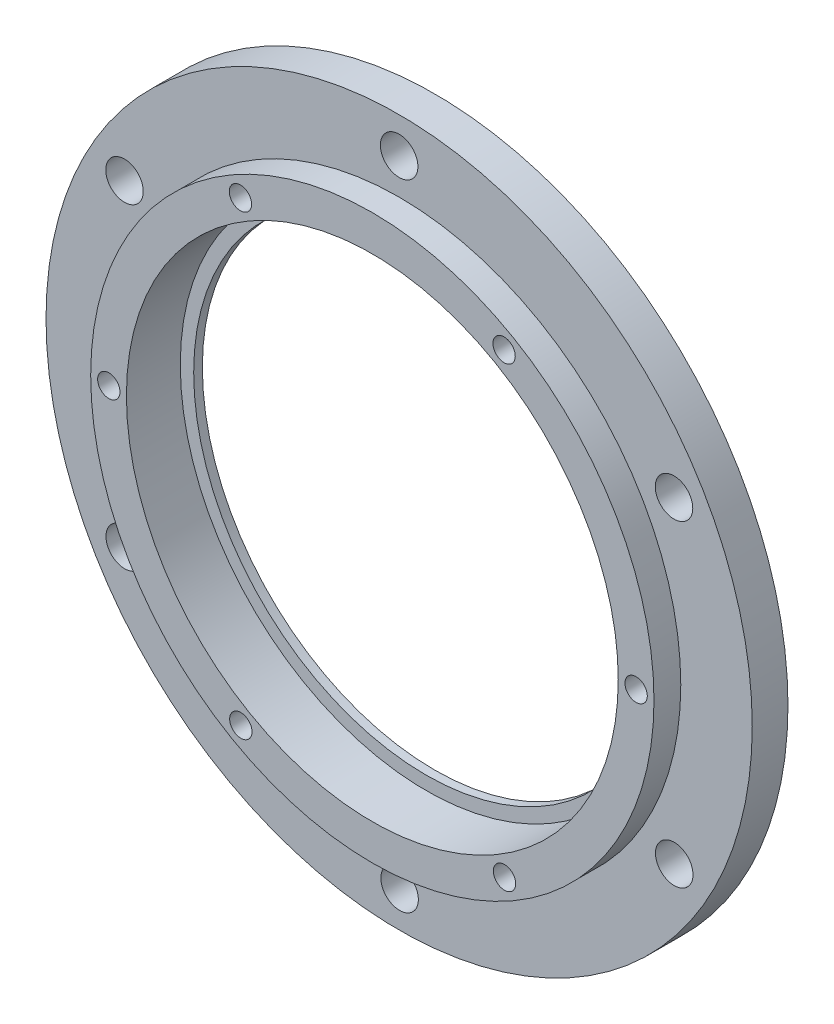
ISO-10303-21;
HEADER;
FILE_DESCRIPTION(('STEP AP214'),'2;1');
FILE_NAME('part.step','',(''),(''),'','','');
FILE_SCHEMA(('AUTOMOTIVE_DESIGN { 1 0 10303 214 1 1 1 1 }'));
ENDSEC;
DATA;
#1=APPLICATION_CONTEXT('core data for automotive mechanical design processes');
#2=APPLICATION_PROTOCOL_DEFINITION('international standard','automotive_design',2000,#1);
#3=PRODUCT_CONTEXT('',#1,'mechanical');
#4=PRODUCT('Part','Part','',(#3));
#5=PRODUCT_RELATED_PRODUCT_CATEGORY('part','',(#4));
#6=PRODUCT_DEFINITION_FORMATION('','',#4);
#7=PRODUCT_DEFINITION_CONTEXT('part definition',#1,'design');
#8=PRODUCT_DEFINITION('design','',#6,#7);
#9=PRODUCT_DEFINITION_SHAPE('','',#8);
#10=(LENGTH_UNIT() NAMED_UNIT(*) SI_UNIT(.MILLI.,.METRE.));
#11=(NAMED_UNIT(*) PLANE_ANGLE_UNIT() SI_UNIT($,.RADIAN.));
#12=(NAMED_UNIT(*) SI_UNIT($,.STERADIAN.) SOLID_ANGLE_UNIT());
#13=UNCERTAINTY_MEASURE_WITH_UNIT(LENGTH_MEASURE(1.E-05),#10,'distance_accuracy_value','');
#14=(GEOMETRIC_REPRESENTATION_CONTEXT(3) GLOBAL_UNCERTAINTY_ASSIGNED_CONTEXT((#13)) GLOBAL_UNIT_ASSIGNED_CONTEXT((#10,
#11,#12)) REPRESENTATION_CONTEXT('',''));
#15=CARTESIAN_POINT('',(0.,0.,0.));
#16=DIRECTION('',(0.,0.,1.));
#17=DIRECTION('',(1.,0.,0.));
#18=AXIS2_PLACEMENT_3D('',#15,#16,#17);
#19=CARTESIAN_POINT('',(0.,0.,-3.03));
#20=DIRECTION('',(0.,0.,1.));
#21=DIRECTION('',(1.,0.,0.));
#22=AXIS2_PLACEMENT_3D('',#19,#20,#21);
#23=PLANE('',#22);
#24=CARTESIAN_POINT('',(0.,0.,-3.03));
#25=DIRECTION('',(0.,0.,-1.));
#26=DIRECTION('',(1.,0.,0.));
#27=AXIS2_PLACEMENT_3D('',#24,#25,#26);
#28=CIRCLE('',#27,26.03);
#29=CARTESIAN_POINT('',(26.03,0.,-3.03));
#30=VERTEX_POINT('',#29);
#31=EDGE_CURVE('E19',#30,#30,#28,.T.);
#32=ORIENTED_EDGE('',*,*,#31,.T.);
#33=EDGE_LOOP('',(#32));
#34=FACE_BOUND('',#33,.T.);
#35=CARTESIAN_POINT('',(0.,0.,-3.03));
#36=DIRECTION('',(0.,0.,1.));
#37=DIRECTION('',(1.,0.,0.));
#38=AXIS2_PLACEMENT_3D('',#35,#36,#37);
#39=CIRCLE('',#38,27.53);
#40=CARTESIAN_POINT('',(27.53,0.,-3.03));
#41=VERTEX_POINT('',#40);
#42=EDGE_CURVE('E32',#41,#41,#39,.T.);
#43=ORIENTED_EDGE('',*,*,#42,.T.);
#44=EDGE_LOOP('',(#43));
#45=FACE_BOUND('',#44,.T.);
#46=ADVANCED_FACE('F15',(#34,#45),#23,.T.);
#47=CARTESIAN_POINT('',(29.5299999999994,0.0519615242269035,-2.));
#48=DIRECTION('',(0.,0.,1.));
#49=DIRECTION('',(1.,0.,0.));
#50=AXIS2_PLACEMENT_3D('',#47,#48,#49);
#51=PLANE('',#50);
#52=CARTESIAN_POINT('',(29.5299999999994,0.0519615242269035,-2.));
#53=DIRECTION('',(0.,0.,1.));
#54=DIRECTION('',(1.,0.,0.));
#55=AXIS2_PLACEMENT_3D('',#52,#53,#54);
#56=CIRCLE('',#55,1.25);
#57=CARTESIAN_POINT('',(30.7799999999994,0.0519615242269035,-2.));
#58=VERTEX_POINT('',#57);
#59=EDGE_CURVE('E146',#58,#58,#56,.T.);
#60=ORIENTED_EDGE('',*,*,#59,.T.);
#61=EDGE_LOOP('',(#60));
#62=FACE_BOUND('',#61,.T.);
#63=ADVANCED_FACE('F17',(#62),#51,.T.);
#64=CARTESIAN_POINT('',(14.7499999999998,25.5997109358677,-2.));
#65=DIRECTION('',(0.,0.,1.));
#66=DIRECTION('',(1.,0.,0.));
#67=AXIS2_PLACEMENT_3D('',#64,#65,#66);
#68=PLANE('',#67);
#69=CARTESIAN_POINT('',(14.7499999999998,25.5997109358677,-2.));
#70=DIRECTION('',(0.,0.,1.));
#71=DIRECTION('',(1.,0.,0.));
#72=AXIS2_PLACEMENT_3D('',#69,#70,#71);
#73=CIRCLE('',#72,1.25);
#74=CARTESIAN_POINT('',(15.9999999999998,25.5997109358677,-2.));
#75=VERTEX_POINT('',#74);
#76=EDGE_CURVE('E135',#75,#75,#73,.T.);
#77=ORIENTED_EDGE('',*,*,#76,.T.);
#78=EDGE_LOOP('',(#77));
#79=FACE_BOUND('',#78,.T.);
#80=ADVANCED_FACE('F197',(#79),#68,.T.);
#81=CARTESIAN_POINT('',(-14.7649999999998,25.5737301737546,-2.));
#82=DIRECTION('',(0.,0.,1.));
#83=DIRECTION('',(1.,0.,0.));
#84=AXIS2_PLACEMENT_3D('',#81,#82,#83);
#85=PLANE('',#84);
#86=CARTESIAN_POINT('',(-14.7649999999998,25.5737301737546,-2.));
#87=DIRECTION('',(0.,0.,1.));
#88=DIRECTION('',(1.,0.,0.));
#89=AXIS2_PLACEMENT_3D('',#86,#87,#88);
#90=CIRCLE('',#89,1.25);
#91=CARTESIAN_POINT('',(-13.5149999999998,25.5737301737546,-2.));
#92=VERTEX_POINT('',#91);
#93=EDGE_CURVE('E124',#92,#92,#90,.T.);
#94=ORIENTED_EDGE('',*,*,#93,.T.);
#95=EDGE_LOOP('',(#94));
#96=FACE_BOUND('',#95,.T.);
#97=ADVANCED_FACE('F225',(#96),#85,.T.);
#98=CARTESIAN_POINT('',(-29.5,5.11743425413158E-13,-2.));
#99=DIRECTION('',(0.,0.,1.));
#100=DIRECTION('',(1.,0.,0.));
#101=AXIS2_PLACEMENT_3D('',#98,#99,#100);
#102=PLANE('',#101);
#103=CARTESIAN_POINT('',(-29.5,5.11743425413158E-13,-2.));
#104=DIRECTION('',(0.,0.,1.));
#105=DIRECTION('',(1.,0.,0.));
#106=AXIS2_PLACEMENT_3D('',#103,#104,#105);
#107=CIRCLE('',#106,1.25);
#108=CARTESIAN_POINT('',(-28.25,5.11743425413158E-13,-2.));
#109=VERTEX_POINT('',#108);
#110=EDGE_CURVE('E123',#109,#109,#107,.T.);
#111=ORIENTED_EDGE('',*,*,#110,.T.);
#112=EDGE_LOOP('',(#111));
#113=FACE_BOUND('',#112,.T.);
#114=ADVANCED_FACE('F221',(#113),#102,.T.);
#115=CARTESIAN_POINT('',(-14.7200000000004,-25.5477494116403,-2.));
#116=DIRECTION('',(0.,0.,1.));
#117=DIRECTION('',(1.,0.,0.));
#118=AXIS2_PLACEMENT_3D('',#115,#116,#117);
#119=PLANE('',#118);
#120=CARTESIAN_POINT('',(-14.7200000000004,-25.5477494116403,-2.));
#121=DIRECTION('',(0.,0.,1.));
#122=DIRECTION('',(1.,0.,0.));
#123=AXIS2_PLACEMENT_3D('',#120,#121,#122);
#124=CIRCLE('',#123,1.25);
#125=CARTESIAN_POINT('',(-13.4700000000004,-25.5477494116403,-2.));
#126=VERTEX_POINT('',#125);
#127=EDGE_CURVE('E114',#126,#126,#124,.T.);
#128=ORIENTED_EDGE('',*,*,#127,.T.);
#129=EDGE_LOOP('',(#128));
#130=FACE_BOUND('',#129,.T.);
#131=ADVANCED_FACE('F217',(#130),#119,.T.);
#132=CARTESIAN_POINT('',(14.7949999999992,-25.5217686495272,-2.));
#133=DIRECTION('',(0.,0.,1.));
#134=DIRECTION('',(1.,0.,0.));
#135=AXIS2_PLACEMENT_3D('',#132,#133,#134);
#136=PLANE('',#135);
#137=CARTESIAN_POINT('',(14.7949999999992,-25.5217686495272,-2.));
#138=DIRECTION('',(0.,0.,1.));
#139=DIRECTION('',(1.,0.,0.));
#140=AXIS2_PLACEMENT_3D('',#137,#138,#139);
#141=CIRCLE('',#140,1.25);
#142=CARTESIAN_POINT('',(16.0449999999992,-25.5217686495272,-2.));
#143=VERTEX_POINT('',#142);
#144=EDGE_CURVE('E106',#143,#143,#141,.T.);
#145=ORIENTED_EDGE('',*,*,#144,.T.);
#146=EDGE_LOOP('',(#145));
#147=FACE_BOUND('',#146,.T.);
#148=ADVANCED_FACE('F213',(#147),#136,.T.);
#149=CARTESIAN_POINT('',(0.,0.,0.));
#150=DIRECTION('',(0.,0.,-1.));
#151=DIRECTION('',(0.,-1.,0.));
#152=AXIS2_PLACEMENT_3D('',#149,#150,#151);
#153=PLANE('',#152);
#154=CARTESIAN_POINT('',(0.,0.,0.));
#155=DIRECTION('',(0.,0.,1.));
#156=DIRECTION('',(1.,0.,0.));
#157=AXIS2_PLACEMENT_3D('',#154,#155,#156);
#158=CIRCLE('',#157,31.53);
#159=CARTESIAN_POINT('',(31.53,0.,0.));
#160=VERTEX_POINT('',#159);
#161=EDGE_CURVE('E38',#160,#160,#158,.T.);
#162=ORIENTED_EDGE('',*,*,#161,.F.);
#163=EDGE_LOOP('',(#162));
#164=FACE_BOUND('',#163,.T.);
#165=CARTESIAN_POINT('',(0.,35.53,0.));
#166=DIRECTION('',(0.,0.,1.));
#167=DIRECTION('',(1.,0.,0.));
#168=AXIS2_PLACEMENT_3D('',#165,#166,#167);
#169=CIRCLE('',#168,2.1);
#170=CARTESIAN_POINT('',(2.1,35.53,0.));
#171=VERTEX_POINT('',#170);
#172=EDGE_CURVE('E54',#171,#171,#169,.T.);
#173=ORIENTED_EDGE('',*,*,#172,.F.);
#174=EDGE_LOOP('',(#173));
#175=FACE_BOUND('',#174,.T.);
#176=CARTESIAN_POINT('',(-30.7439018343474,17.7500000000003,0.));
#177=DIRECTION('',(0.,0.,1.));
#178=DIRECTION('',(1.,0.,0.));
#179=AXIS2_PLACEMENT_3D('',#176,#177,#178);
#180=CIRCLE('',#179,2.1);
#181=CARTESIAN_POINT('',(-28.6439018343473,17.7500000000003,0.));
#182=VERTEX_POINT('',#181);
#183=EDGE_CURVE('E55',#182,#182,#180,.T.);
#184=ORIENTED_EDGE('',*,*,#183,.F.);
#185=EDGE_LOOP('',(#184));
#186=FACE_BOUND('',#185,.T.);
#187=CARTESIAN_POINT('',(30.7698825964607,17.795,0.));
#188=DIRECTION('',(0.,0.,1.));
#189=DIRECTION('',(1.,0.,0.));
#190=AXIS2_PLACEMENT_3D('',#187,#188,#189);
#191=CIRCLE('',#190,2.1);
#192=CARTESIAN_POINT('',(32.8698825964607,17.795,0.));
#193=VERTEX_POINT('',#192);
#194=EDGE_CURVE('E67',#193,#193,#191,.T.);
#195=ORIENTED_EDGE('',*,*,#194,.F.);
#196=EDGE_LOOP('',(#195));
#197=FACE_BOUND('',#196,.T.);
#198=CARTESIAN_POINT('',(-30.717921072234,-17.7649999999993,0.));
#199=DIRECTION('',(0.,0.,1.));
#200=DIRECTION('',(1.,0.,0.));
#201=AXIS2_PLACEMENT_3D('',#198,#199,#200);
#202=CIRCLE('',#201,2.1);
#203=CARTESIAN_POINT('',(-28.617921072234,-17.7649999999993,0.));
#204=VERTEX_POINT('',#203);
#205=EDGE_CURVE('E75',#204,#204,#202,.T.);
#206=ORIENTED_EDGE('',*,*,#205,.F.);
#207=EDGE_LOOP('',(#206));
#208=FACE_BOUND('',#207,.T.);
#209=CARTESIAN_POINT('',(30.795863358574,-17.7199999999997,0.));
#210=DIRECTION('',(0.,0.,1.));
#211=DIRECTION('',(1.,0.,0.));
#212=AXIS2_PLACEMENT_3D('',#209,#210,#211);
#213=CIRCLE('',#212,2.1);
#214=CARTESIAN_POINT('',(32.895863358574,-17.7199999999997,0.));
#215=VERTEX_POINT('',#214);
#216=EDGE_CURVE('E83',#215,#215,#213,.T.);
#217=ORIENTED_EDGE('',*,*,#216,.F.);
#218=EDGE_LOOP('',(#217));
#219=FACE_BOUND('',#218,.T.);
#220=CARTESIAN_POINT('',(0.0519615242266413,-35.4999999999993,0.));
#221=DIRECTION('',(0.,0.,1.));
#222=DIRECTION('',(1.,0.,0.));
#223=AXIS2_PLACEMENT_3D('',#220,#221,#222);
#224=CIRCLE('',#223,2.1);
#225=CARTESIAN_POINT('',(2.15196152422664,-35.4999999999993,0.));
#226=VERTEX_POINT('',#225);
#227=EDGE_CURVE('E91',#226,#226,#224,.T.);
#228=ORIENTED_EDGE('',*,*,#227,.F.);
#229=EDGE_LOOP('',(#228));
#230=FACE_BOUND('',#229,.T.);
#231=CARTESIAN_POINT('',(0.,0.,0.));
#232=DIRECTION('',(0.,0.,-1.));
#233=DIRECTION('',(-1.,0.,0.));
#234=AXIS2_PLACEMENT_3D('',#231,#232,#233);
#235=CIRCLE('',#234,39.53);
#236=CARTESIAN_POINT('',(-39.53,0.,0.));
#237=VERTEX_POINT('',#236);
#238=EDGE_CURVE('E49',#237,#237,#235,.T.);
#239=ORIENTED_EDGE('',*,*,#238,.F.);
#240=EDGE_LOOP('',(#239));
#241=FACE_BOUND('',#240,.T.);
#242=ADVANCED_FACE('F206',(#164,#175,#186,#197,#208,#219,#230,#241),#153,.F.);
#243=CARTESIAN_POINT('',(0.,0.,-4.));
#244=DIRECTION('',(0.,0.,-1.));
#245=DIRECTION('',(0.,-1.,0.));
#246=AXIS2_PLACEMENT_3D('',#243,#244,#245);
#247=PLANE('',#246);
#248=CARTESIAN_POINT('',(0.,0.,-4.));
#249=DIRECTION('',(0.,0.,-1.));
#250=DIRECTION('',(-1.,0.,0.));
#251=AXIS2_PLACEMENT_3D('',#248,#249,#250);
#252=CIRCLE('',#251,26.03);
#253=CARTESIAN_POINT('',(-26.03,0.,-4.));
#254=VERTEX_POINT('',#253);
#255=EDGE_CURVE('E10',#254,#254,#252,.T.);
#256=ORIENTED_EDGE('',*,*,#255,.F.);
#257=EDGE_LOOP('',(#256));
#258=FACE_BOUND('',#257,.T.);
#259=CARTESIAN_POINT('',(0.,35.53,-4.));
#260=DIRECTION('',(0.,0.,1.));
#261=DIRECTION('',(1.,0.,0.));
#262=AXIS2_PLACEMENT_3D('',#259,#260,#261);
#263=CIRCLE('',#262,2.1);
#264=CARTESIAN_POINT('',(2.1,35.53,-4.));
#265=VERTEX_POINT('',#264);
#266=EDGE_CURVE('E50',#265,#265,#263,.T.);
#267=ORIENTED_EDGE('',*,*,#266,.T.);
#268=EDGE_LOOP('',(#267));
#269=FACE_BOUND('',#268,.T.);
#270=CARTESIAN_POINT('',(-30.7439018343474,17.7500000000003,-4.));
#271=DIRECTION('',(0.,0.,1.));
#272=DIRECTION('',(1.,0.,0.));
#273=AXIS2_PLACEMENT_3D('',#270,#271,#272);
#274=CIRCLE('',#273,2.1);
#275=CARTESIAN_POINT('',(-28.6439018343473,17.7500000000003,-4.));
#276=VERTEX_POINT('',#275);
#277=EDGE_CURVE('E63',#276,#276,#274,.T.);
#278=ORIENTED_EDGE('',*,*,#277,.T.);
#279=EDGE_LOOP('',(#278));
#280=FACE_BOUND('',#279,.T.);
#281=CARTESIAN_POINT('',(30.7698825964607,17.795,-4.));
#282=DIRECTION('',(0.,0.,1.));
#283=DIRECTION('',(1.,0.,0.));
#284=AXIS2_PLACEMENT_3D('',#281,#282,#283);
#285=CIRCLE('',#284,2.1);
#286=CARTESIAN_POINT('',(32.8698825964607,17.795,-4.));
#287=VERTEX_POINT('',#286);
#288=EDGE_CURVE('E71',#287,#287,#285,.T.);
#289=ORIENTED_EDGE('',*,*,#288,.T.);
#290=EDGE_LOOP('',(#289));
#291=FACE_BOUND('',#290,.T.);
#292=CARTESIAN_POINT('',(-30.717921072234,-17.7649999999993,-4.));
#293=DIRECTION('',(0.,0.,1.));
#294=DIRECTION('',(1.,0.,0.));
#295=AXIS2_PLACEMENT_3D('',#292,#293,#294);
#296=CIRCLE('',#295,2.1);
#297=CARTESIAN_POINT('',(-28.617921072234,-17.7649999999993,-4.));
#298=VERTEX_POINT('',#297);
#299=EDGE_CURVE('E79',#298,#298,#296,.T.);
#300=ORIENTED_EDGE('',*,*,#299,.T.);
#301=EDGE_LOOP('',(#300));
#302=FACE_BOUND('',#301,.T.);
#303=CARTESIAN_POINT('',(30.795863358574,-17.7199999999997,-4.));
#304=DIRECTION('',(0.,0.,1.));
#305=DIRECTION('',(1.,0.,0.));
#306=AXIS2_PLACEMENT_3D('',#303,#304,#305);
#307=CIRCLE('',#306,2.1);
#308=CARTESIAN_POINT('',(32.895863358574,-17.7199999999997,-4.));
#309=VERTEX_POINT('',#308);
#310=EDGE_CURVE('E87',#309,#309,#307,.T.);
#311=ORIENTED_EDGE('',*,*,#310,.T.);
#312=EDGE_LOOP('',(#311));
#313=FACE_BOUND('',#312,.T.);
#314=CARTESIAN_POINT('',(0.0519615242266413,-35.4999999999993,-4.));
#315=DIRECTION('',(0.,0.,1.));
#316=DIRECTION('',(1.,0.,0.));
#317=AXIS2_PLACEMENT_3D('',#314,#315,#316);
#318=CIRCLE('',#317,2.1);
#319=CARTESIAN_POINT('',(2.15196152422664,-35.4999999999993,-4.));
#320=VERTEX_POINT('',#319);
#321=EDGE_CURVE('E95',#320,#320,#318,.T.);
#322=ORIENTED_EDGE('',*,*,#321,.T.);
#323=EDGE_LOOP('',(#322));
#324=FACE_BOUND('',#323,.T.);
#325=CARTESIAN_POINT('',(0.,0.,-4.));
#326=DIRECTION('',(0.,0.,-1.));
#327=DIRECTION('',(-1.,0.,0.));
#328=AXIS2_PLACEMENT_3D('',#325,#326,#327);
#329=CIRCLE('',#328,39.53);
#330=CARTESIAN_POINT('',(-39.53,0.,-4.));
#331=VERTEX_POINT('',#330);
#332=EDGE_CURVE('E59',#331,#331,#329,.T.);
#333=ORIENTED_EDGE('',*,*,#332,.T.);
#334=EDGE_LOOP('',(#333));
#335=FACE_BOUND('',#334,.T.);
#336=ADVANCED_FACE('F163',(#258,#269,#280,#291,#302,#313,#324,#335),#247,.T.);
#337=CARTESIAN_POINT('',(0.,0.,3.));
#338=DIRECTION('',(0.,0.,1.));
#339=DIRECTION('',(1.,0.,0.));
#340=AXIS2_PLACEMENT_3D('',#337,#338,#339);
#341=PLANE('',#340);
#342=CARTESIAN_POINT('',(0.,0.,3.));
#343=DIRECTION('',(0.,0.,1.));
#344=DIRECTION('',(1.,0.,0.));
#345=AXIS2_PLACEMENT_3D('',#342,#343,#344);
#346=CIRCLE('',#345,27.53);
#347=CARTESIAN_POINT('',(27.53,0.,3.));
#348=VERTEX_POINT('',#347);
#349=EDGE_CURVE('E34',#348,#348,#346,.T.);
#350=ORIENTED_EDGE('',*,*,#349,.F.);
#351=EDGE_LOOP('',(#350));
#352=FACE_BOUND('',#351,.T.);
#353=CARTESIAN_POINT('',(14.7949999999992,-25.5217686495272,3.));
#354=DIRECTION('',(0.,0.,1.));
#355=DIRECTION('',(1.,0.,0.));
#356=AXIS2_PLACEMENT_3D('',#353,#354,#355);
#357=CIRCLE('',#356,1.25);
#358=CARTESIAN_POINT('',(16.0449999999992,-25.5217686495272,3.));
#359=VERTEX_POINT('',#358);
#360=EDGE_CURVE('E102',#359,#359,#357,.T.);
#361=ORIENTED_EDGE('',*,*,#360,.F.);
#362=EDGE_LOOP('',(#361));
#363=FACE_BOUND('',#362,.T.);
#364=CARTESIAN_POINT('',(-14.7200000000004,-25.5477494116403,3.));
#365=DIRECTION('',(0.,0.,1.));
#366=DIRECTION('',(1.,0.,0.));
#367=AXIS2_PLACEMENT_3D('',#364,#365,#366);
#368=CIRCLE('',#367,1.25);
#369=CARTESIAN_POINT('',(-13.4700000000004,-25.5477494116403,3.));
#370=VERTEX_POINT('',#369);
#371=EDGE_CURVE('E110',#370,#370,#368,.T.);
#372=ORIENTED_EDGE('',*,*,#371,.F.);
#373=EDGE_LOOP('',(#372));
#374=FACE_BOUND('',#373,.T.);
#375=CARTESIAN_POINT('',(-29.5,5.11743425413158E-13,3.));
#376=DIRECTION('',(0.,0.,1.));
#377=DIRECTION('',(1.,0.,0.));
#378=AXIS2_PLACEMENT_3D('',#375,#376,#377);
#379=CIRCLE('',#378,1.25);
#380=CARTESIAN_POINT('',(-28.25,5.11743425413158E-13,3.));
#381=VERTEX_POINT('',#380);
#382=EDGE_CURVE('E118',#381,#381,#379,.T.);
#383=ORIENTED_EDGE('',*,*,#382,.F.);
#384=EDGE_LOOP('',(#383));
#385=FACE_BOUND('',#384,.T.);
#386=CARTESIAN_POINT('',(-14.7649999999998,25.5737301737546,3.));
#387=DIRECTION('',(0.,0.,1.));
#388=DIRECTION('',(1.,0.,0.));
#389=AXIS2_PLACEMENT_3D('',#386,#387,#388);
#390=CIRCLE('',#389,1.25);
#391=CARTESIAN_POINT('',(-13.5149999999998,25.5737301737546,3.));
#392=VERTEX_POINT('',#391);
#393=EDGE_CURVE('E119',#392,#392,#390,.T.);
#394=ORIENTED_EDGE('',*,*,#393,.F.);
#395=EDGE_LOOP('',(#394));
#396=FACE_BOUND('',#395,.T.);
#397=CARTESIAN_POINT('',(14.7499999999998,25.5997109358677,3.));
#398=DIRECTION('',(0.,0.,1.));
#399=DIRECTION('',(1.,0.,0.));
#400=AXIS2_PLACEMENT_3D('',#397,#398,#399);
#401=CIRCLE('',#400,1.25);
#402=CARTESIAN_POINT('',(15.9999999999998,25.5997109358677,3.));
#403=VERTEX_POINT('',#402);
#404=EDGE_CURVE('E128',#403,#403,#401,.T.);
#405=ORIENTED_EDGE('',*,*,#404,.F.);
#406=EDGE_LOOP('',(#405));
#407=FACE_BOUND('',#406,.T.);
#408=CARTESIAN_POINT('',(29.5299999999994,0.0519615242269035,3.));
#409=DIRECTION('',(0.,0.,1.));
#410=DIRECTION('',(1.,0.,0.));
#411=AXIS2_PLACEMENT_3D('',#408,#409,#410);
#412=CIRCLE('',#411,1.25);
#413=CARTESIAN_POINT('',(30.7799999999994,0.0519615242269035,3.));
#414=VERTEX_POINT('',#413);
#415=EDGE_CURVE('E142',#414,#414,#412,.T.);
#416=ORIENTED_EDGE('',*,*,#415,.F.);
#417=EDGE_LOOP('',(#416));
#418=FACE_BOUND('',#417,.T.);
#419=CARTESIAN_POINT('',(0.,0.,3.));
#420=DIRECTION('',(0.,0.,1.));
#421=DIRECTION('',(1.,0.,0.));
#422=AXIS2_PLACEMENT_3D('',#419,#420,#421);
#423=CIRCLE('',#422,31.53);
#424=CARTESIAN_POINT('',(31.53,0.,3.));
#425=VERTEX_POINT('',#424);
#426=EDGE_CURVE('E42',#425,#425,#423,.T.);
#427=ORIENTED_EDGE('',*,*,#426,.T.);
#428=EDGE_LOOP('',(#427));
#429=FACE_BOUND('',#428,.T.);
#430=ADVANCED_FACE('F159',(#352,#363,#374,#385,#396,#407,#418,#429),#341,.T.);
#431=CARTESIAN_POINT('',(0.,0.,-3.));
#432=DIRECTION('',(0.,0.,-1.));
#433=DIRECTION('',(-1.,0.,0.));
#434=AXIS2_PLACEMENT_3D('',#431,#432,#433);
#435=CYLINDRICAL_SURFACE('',#434,26.03);
#436=ORIENTED_EDGE('',*,*,#255,.T.);
#437=EDGE_LOOP('',(#436));
#438=FACE_BOUND('',#437,.T.);
#439=ORIENTED_EDGE('',*,*,#31,.F.);
#440=EDGE_LOOP('',(#439));
#441=FACE_BOUND('',#440,.T.);
#442=ADVANCED_FACE('F162',(#438,#441),#435,.F.);
#443=CARTESIAN_POINT('',(0.,0.,3.));
#444=DIRECTION('',(0.,0.,-1.));
#445=DIRECTION('',(-1.,0.,0.));
#446=AXIS2_PLACEMENT_3D('',#443,#444,#445);
#447=CYLINDRICAL_SURFACE('',#446,27.53);
#448=ORIENTED_EDGE('',*,*,#42,.F.);
#449=EDGE_LOOP('',(#448));
#450=FACE_BOUND('',#449,.T.);
#451=ORIENTED_EDGE('',*,*,#349,.T.);
#452=EDGE_LOOP('',(#451));
#453=FACE_BOUND('',#452,.T.);
#454=ADVANCED_FACE('F177',(#450,#453),#447,.F.);
#455=CARTESIAN_POINT('',(0.,0.,3.));
#456=DIRECTION('',(0.,0.,-1.));
#457=DIRECTION('',(-1.,0.,0.));
#458=AXIS2_PLACEMENT_3D('',#455,#456,#457);
#459=CYLINDRICAL_SURFACE('',#458,31.53);
#460=ORIENTED_EDGE('',*,*,#161,.T.);
#461=EDGE_LOOP('',(#460));
#462=FACE_BOUND('',#461,.T.);
#463=ORIENTED_EDGE('',*,*,#426,.F.);
#464=EDGE_LOOP('',(#463));
#465=FACE_BOUND('',#464,.T.);
#466=ADVANCED_FACE('F174',(#462,#465),#459,.T.);
#467=CARTESIAN_POINT('',(0.,0.,-4.));
#468=DIRECTION('',(0.,0.,1.));
#469=DIRECTION('',(1.,0.,0.));
#470=AXIS2_PLACEMENT_3D('',#467,#468,#469);
#471=CYLINDRICAL_SURFACE('',#470,39.53);
#472=ORIENTED_EDGE('',*,*,#238,.T.);
#473=EDGE_LOOP('',(#472));
#474=FACE_BOUND('',#473,.T.);
#475=ORIENTED_EDGE('',*,*,#332,.F.);
#476=EDGE_LOOP('',(#475));
#477=FACE_BOUND('',#476,.T.);
#478=ADVANCED_FACE('F176',(#474,#477),#471,.T.);
#479=CARTESIAN_POINT('',(0.,35.53,-4.));
#480=DIRECTION('',(0.,0.,1.));
#481=DIRECTION('',(1.,0.,0.));
#482=AXIS2_PLACEMENT_3D('',#479,#480,#481);
#483=CYLINDRICAL_SURFACE('',#482,2.1);
#484=ORIENTED_EDGE('',*,*,#172,.T.);
#485=EDGE_LOOP('',(#484));
#486=FACE_BOUND('',#485,.T.);
#487=ORIENTED_EDGE('',*,*,#266,.F.);
#488=EDGE_LOOP('',(#487));
#489=FACE_BOUND('',#488,.T.);
#490=ADVANCED_FACE('F185',(#486,#489),#483,.F.);
#491=CARTESIAN_POINT('',(-30.7439018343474,17.7500000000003,-4.));
#492=DIRECTION('',(0.,0.,1.));
#493=DIRECTION('',(1.,0.,0.));
#494=AXIS2_PLACEMENT_3D('',#491,#492,#493);
#495=CYLINDRICAL_SURFACE('',#494,2.1);
#496=ORIENTED_EDGE('',*,*,#183,.T.);
#497=EDGE_LOOP('',(#496));
#498=FACE_BOUND('',#497,.T.);
#499=ORIENTED_EDGE('',*,*,#277,.F.);
#500=EDGE_LOOP('',(#499));
#501=FACE_BOUND('',#500,.T.);
#502=ADVANCED_FACE('F203',(#498,#501),#495,.F.);
#503=CARTESIAN_POINT('',(30.7698825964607,17.795,-4.));
#504=DIRECTION('',(0.,0.,1.));
#505=DIRECTION('',(1.,0.,0.));
#506=AXIS2_PLACEMENT_3D('',#503,#504,#505);
#507=CYLINDRICAL_SURFACE('',#506,2.1);
#508=ORIENTED_EDGE('',*,*,#194,.T.);
#509=EDGE_LOOP('',(#508));
#510=FACE_BOUND('',#509,.T.);
#511=ORIENTED_EDGE('',*,*,#288,.F.);
#512=EDGE_LOOP('',(#511));
#513=FACE_BOUND('',#512,.T.);
#514=ADVANCED_FACE('F262',(#510,#513),#507,.F.);
#515=CARTESIAN_POINT('',(-30.717921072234,-17.7649999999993,-4.));
#516=DIRECTION('',(0.,0.,1.));
#517=DIRECTION('',(1.,0.,0.));
#518=AXIS2_PLACEMENT_3D('',#515,#516,#517);
#519=CYLINDRICAL_SURFACE('',#518,2.1);
#520=ORIENTED_EDGE('',*,*,#205,.T.);
#521=EDGE_LOOP('',(#520));
#522=FACE_BOUND('',#521,.T.);
#523=ORIENTED_EDGE('',*,*,#299,.F.);
#524=EDGE_LOOP('',(#523));
#525=FACE_BOUND('',#524,.T.);
#526=ADVANCED_FACE('F250',(#522,#525),#519,.F.);
#527=CARTESIAN_POINT('',(30.795863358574,-17.7199999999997,-4.));
#528=DIRECTION('',(0.,0.,1.));
#529=DIRECTION('',(1.,0.,0.));
#530=AXIS2_PLACEMENT_3D('',#527,#528,#529);
#531=CYLINDRICAL_SURFACE('',#530,2.1);
#532=ORIENTED_EDGE('',*,*,#216,.T.);
#533=EDGE_LOOP('',(#532));
#534=FACE_BOUND('',#533,.T.);
#535=ORIENTED_EDGE('',*,*,#310,.F.);
#536=EDGE_LOOP('',(#535));
#537=FACE_BOUND('',#536,.T.);
#538=ADVANCED_FACE('F265',(#534,#537),#531,.F.);
#539=CARTESIAN_POINT('',(0.0519615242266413,-35.4999999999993,-4.));
#540=DIRECTION('',(0.,0.,1.));
#541=DIRECTION('',(1.,0.,0.));
#542=AXIS2_PLACEMENT_3D('',#539,#540,#541);
#543=CYLINDRICAL_SURFACE('',#542,2.1);
#544=ORIENTED_EDGE('',*,*,#227,.T.);
#545=EDGE_LOOP('',(#544));
#546=FACE_BOUND('',#545,.T.);
#547=ORIENTED_EDGE('',*,*,#321,.F.);
#548=EDGE_LOOP('',(#547));
#549=FACE_BOUND('',#548,.T.);
#550=ADVANCED_FACE('F258',(#546,#549),#543,.F.);
#551=CARTESIAN_POINT('',(14.7949999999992,-25.5217686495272,-2.));
#552=DIRECTION('',(0.,0.,1.));
#553=DIRECTION('',(1.,0.,0.));
#554=AXIS2_PLACEMENT_3D('',#551,#552,#553);
#555=CYLINDRICAL_SURFACE('',#554,1.25);
#556=ORIENTED_EDGE('',*,*,#360,.T.);
#557=EDGE_LOOP('',(#556));
#558=FACE_BOUND('',#557,.T.);
#559=ORIENTED_EDGE('',*,*,#144,.F.);
#560=EDGE_LOOP('',(#559));
#561=FACE_BOUND('',#560,.T.);
#562=ADVANCED_FACE('F254',(#558,#561),#555,.F.);
#563=CARTESIAN_POINT('',(-14.7200000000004,-25.5477494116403,-2.));
#564=DIRECTION('',(0.,0.,1.));
#565=DIRECTION('',(1.,0.,0.));
#566=AXIS2_PLACEMENT_3D('',#563,#564,#565);
#567=CYLINDRICAL_SURFACE('',#566,1.25);
#568=ORIENTED_EDGE('',*,*,#371,.T.);
#569=EDGE_LOOP('',(#568));
#570=FACE_BOUND('',#569,.T.);
#571=ORIENTED_EDGE('',*,*,#127,.F.);
#572=EDGE_LOOP('',(#571));
#573=FACE_BOUND('',#572,.T.);
#574=ADVANCED_FACE('F247',(#570,#573),#567,.F.);
#575=CARTESIAN_POINT('',(-29.5,5.11743425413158E-13,-2.));
#576=DIRECTION('',(0.,0.,1.));
#577=DIRECTION('',(1.,0.,0.));
#578=AXIS2_PLACEMENT_3D('',#575,#576,#577);
#579=CYLINDRICAL_SURFACE('',#578,1.25);
#580=ORIENTED_EDGE('',*,*,#382,.T.);
#581=EDGE_LOOP('',(#580));
#582=FACE_BOUND('',#581,.T.);
#583=ORIENTED_EDGE('',*,*,#110,.F.);
#584=EDGE_LOOP('',(#583));
#585=FACE_BOUND('',#584,.T.);
#586=ADVANCED_FACE('F156',(#582,#585),#579,.F.);
#587=CARTESIAN_POINT('',(-14.7649999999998,25.5737301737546,-2.));
#588=DIRECTION('',(0.,0.,1.));
#589=DIRECTION('',(1.,0.,0.));
#590=AXIS2_PLACEMENT_3D('',#587,#588,#589);
#591=CYLINDRICAL_SURFACE('',#590,1.25);
#592=ORIENTED_EDGE('',*,*,#393,.T.);
#593=EDGE_LOOP('',(#592));
#594=FACE_BOUND('',#593,.T.);
#595=ORIENTED_EDGE('',*,*,#93,.F.);
#596=EDGE_LOOP('',(#595));
#597=FACE_BOUND('',#596,.T.);
#598=ADVANCED_FACE('F235',(#594,#597),#591,.F.);
#599=CARTESIAN_POINT('',(14.7499999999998,25.5997109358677,-2.));
#600=DIRECTION('',(0.,0.,1.));
#601=DIRECTION('',(1.,0.,0.));
#602=AXIS2_PLACEMENT_3D('',#599,#600,#601);
#603=CYLINDRICAL_SURFACE('',#602,1.25);
#604=ORIENTED_EDGE('',*,*,#404,.T.);
#605=EDGE_LOOP('',(#604));
#606=FACE_BOUND('',#605,.T.);
#607=ORIENTED_EDGE('',*,*,#76,.F.);
#608=EDGE_LOOP('',(#607));
#609=FACE_BOUND('',#608,.T.);
#610=ADVANCED_FACE('F237',(#606,#609),#603,.F.);
#611=CARTESIAN_POINT('',(29.5299999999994,0.0519615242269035,-2.));
#612=DIRECTION('',(0.,0.,1.));
#613=DIRECTION('',(1.,0.,0.));
#614=AXIS2_PLACEMENT_3D('',#611,#612,#613);
#615=CYLINDRICAL_SURFACE('',#614,1.25);
#616=ORIENTED_EDGE('',*,*,#415,.T.);
#617=EDGE_LOOP('',(#616));
#618=FACE_BOUND('',#617,.T.);
#619=ORIENTED_EDGE('',*,*,#59,.F.);
#620=EDGE_LOOP('',(#619));
#621=FACE_BOUND('',#620,.T.);
#622=ADVANCED_FACE('F244',(#618,#621),#615,.F.);
#623=CLOSED_SHELL('',(#46,#63,#80,#97,#114,#131,#148,#242,#336,#430,#442,#454,#466,#478,#490,
#502,#514,#526,#538,#550,#562,#574,#586,#598,#610,#622));
#624=MANIFOLD_SOLID_BREP('B1',#623);
#625=ADVANCED_BREP_SHAPE_REPRESENTATION('',(#18,#624),#14);
#626=SHAPE_DEFINITION_REPRESENTATION(#9,#625);
ENDSEC;
END-ISO-10303-21;
